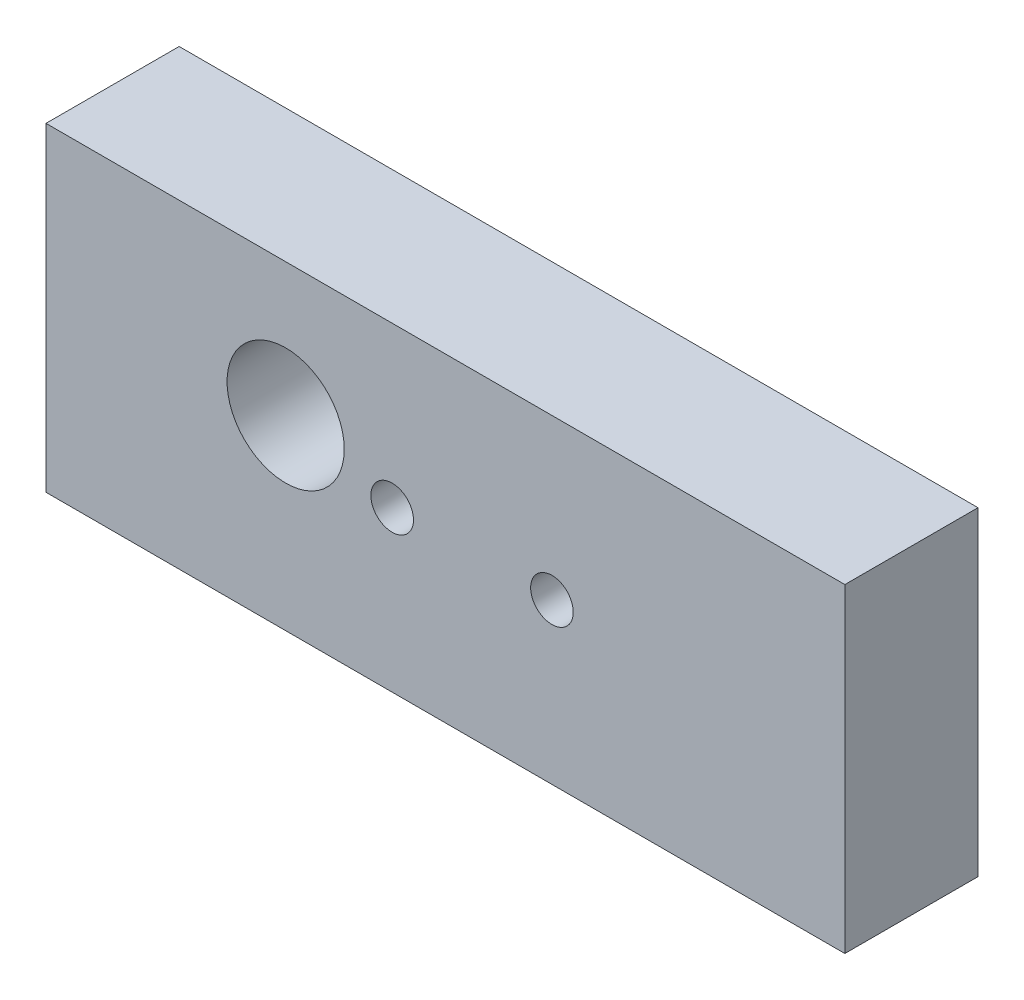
from build123d import *

# Parameters (mm, degrees)
SKETCH_1_W          = 150
SKETCH_1_H          = 60
EXTRUDE_1_DEPTH     = 25
SKETCH_2_R          = 11
CUT_EXTRUDE_1_DEPTH = 20
SKETCH_3_R          = 4
CUT_EXTRUDE_2_DEPTH = 20


with BuildPart() as part:
    # Sketch 1 → Extrude 1 (new body)
    with BuildSketch(Plane.XY):
        with Locations((75, 30)):
            Rectangle(SKETCH_1_W, SKETCH_1_H)
    extrude(amount=-EXTRUDE_1_DEPTH)

    # Sketch 2 → Cut-Extrude 1 (cut)
    with BuildSketch(Plane.XY):
        with Locations((45, 35)):
            Circle(SKETCH_2_R)
    extrude(amount=-CUT_EXTRUDE_1_DEPTH, mode=Mode.SUBTRACT)

    # Sketch 3 → Cut-Extrude 2 (cut)
    with BuildSketch(Plane.XY):
        with Locations((65, 30)):
            Circle(SKETCH_3_R)
        with Locations((95, 30)):
            Circle(SKETCH_3_R)
    extrude(amount=-CUT_EXTRUDE_2_DEPTH, mode=Mode.SUBTRACT)


solid = part.part
